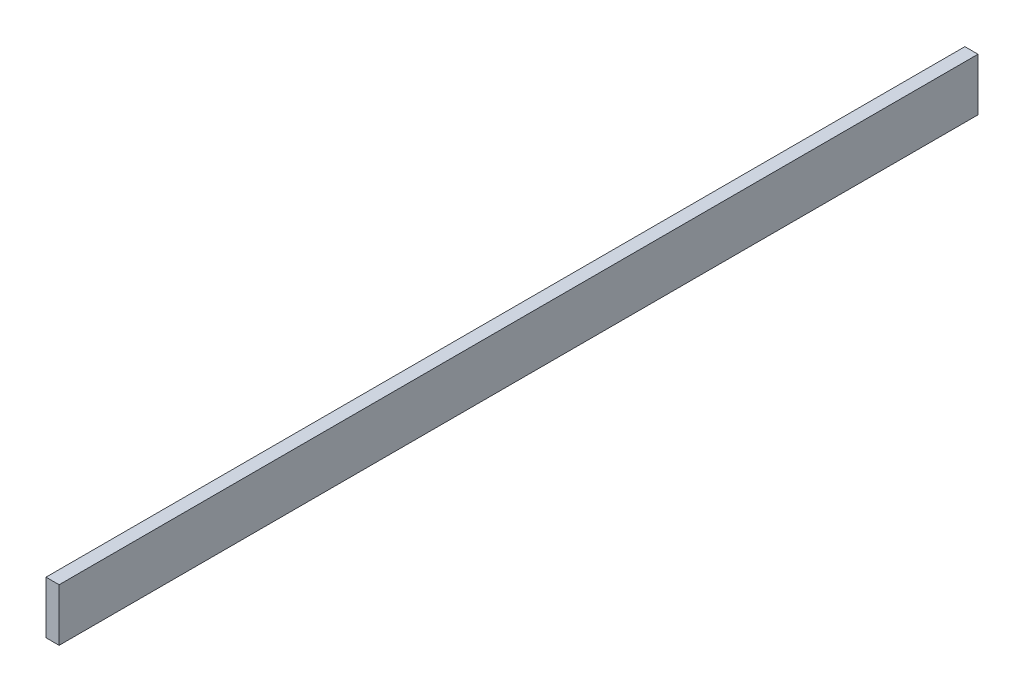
ISO-10303-21;
HEADER;
FILE_DESCRIPTION(('STEP AP214'),'2;1');
FILE_NAME('part.step','',(''),(''),'','','');
FILE_SCHEMA(('AUTOMOTIVE_DESIGN { 1 0 10303 214 1 1 1 1 }'));
ENDSEC;
DATA;
#1=APPLICATION_CONTEXT('core data for automotive mechanical design processes');
#2=APPLICATION_PROTOCOL_DEFINITION('international standard','automotive_design',2000,#1);
#3=PRODUCT_CONTEXT('',#1,'mechanical');
#4=PRODUCT('Part','Part','',(#3));
#5=PRODUCT_RELATED_PRODUCT_CATEGORY('part','',(#4));
#6=PRODUCT_DEFINITION_FORMATION('','',#4);
#7=PRODUCT_DEFINITION_CONTEXT('part definition',#1,'design');
#8=PRODUCT_DEFINITION('design','',#6,#7);
#9=PRODUCT_DEFINITION_SHAPE('','',#8);
#10=(LENGTH_UNIT() NAMED_UNIT(*) SI_UNIT(.MILLI.,.METRE.));
#11=(NAMED_UNIT(*) PLANE_ANGLE_UNIT() SI_UNIT($,.RADIAN.));
#12=(NAMED_UNIT(*) SI_UNIT($,.STERADIAN.) SOLID_ANGLE_UNIT());
#13=UNCERTAINTY_MEASURE_WITH_UNIT(LENGTH_MEASURE(1.E-05),#10,'distance_accuracy_value','');
#14=(GEOMETRIC_REPRESENTATION_CONTEXT(3) GLOBAL_UNCERTAINTY_ASSIGNED_CONTEXT((#13)) GLOBAL_UNIT_ASSIGNED_CONTEXT((#10,
#11,#12)) REPRESENTATION_CONTEXT('',''));
#15=CARTESIAN_POINT('',(0.,0.,0.));
#16=DIRECTION('',(0.,0.,1.));
#17=DIRECTION('',(1.,0.,0.));
#18=AXIS2_PLACEMENT_3D('',#15,#16,#17);
#19=CARTESIAN_POINT('',(-2.50000000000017,20.,350.));
#20=DIRECTION('',(1.,0.,0.));
#21=DIRECTION('',(0.,1.,0.));
#22=AXIS2_PLACEMENT_3D('',#19,#20,#21);
#23=PLANE('',#22);
#24=DIRECTION('',(0.,-1.,0.));
#25=VECTOR('',#24,1.);
#26=CARTESIAN_POINT('',(-2.5,20.,0.));
#27=LINE('',#26,#25);
#28=CARTESIAN_POINT('',(-2.5,20.,0.));
#29=VERTEX_POINT('',#28);
#30=CARTESIAN_POINT('',(-2.5,0.,0.));
#31=VERTEX_POINT('',#30);
#32=EDGE_CURVE('E83',#29,#31,#27,.T.);
#33=ORIENTED_EDGE('',*,*,#32,.T.);
#34=DIRECTION('',(0.,0.,-1.));
#35=VECTOR('',#34,1.);
#36=CARTESIAN_POINT('',(-2.50000000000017,0.,350.));
#37=LINE('',#36,#35);
#38=CARTESIAN_POINT('',(-2.50000000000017,0.,350.));
#39=VERTEX_POINT('',#38);
#40=EDGE_CURVE('E11',#39,#31,#37,.T.);
#41=ORIENTED_EDGE('',*,*,#40,.F.);
#42=DIRECTION('',(0.,-1.,0.));
#43=VECTOR('',#42,1.);
#44=CARTESIAN_POINT('',(-2.50000000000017,20.,350.));
#45=LINE('',#44,#43);
#46=CARTESIAN_POINT('',(-2.50000000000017,20.,350.));
#47=VERTEX_POINT('',#46);
#48=EDGE_CURVE('E107',#47,#39,#45,.T.);
#49=ORIENTED_EDGE('',*,*,#48,.F.);
#50=DIRECTION('',(0.,0.,-1.));
#51=VECTOR('',#50,1.);
#52=CARTESIAN_POINT('',(-2.50000000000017,20.,350.));
#53=LINE('',#52,#51);
#54=EDGE_CURVE('E96',#47,#29,#53,.T.);
#55=ORIENTED_EDGE('',*,*,#54,.T.);
#56=EDGE_LOOP('',(#33,#41,#49,#55));
#57=FACE_BOUND('',#56,.T.);
#58=ADVANCED_FACE('F38',(#57),#23,.F.);
#59=CARTESIAN_POINT('',(-2.50000000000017,0.,350.));
#60=DIRECTION('',(0.,1.,0.));
#61=DIRECTION('',(0.,0.,1.));
#62=AXIS2_PLACEMENT_3D('',#59,#60,#61);
#63=PLANE('',#62);
#64=DIRECTION('',(1.,0.,0.));
#65=VECTOR('',#64,1.);
#66=CARTESIAN_POINT('',(-2.5,0.,0.));
#67=LINE('',#66,#65);
#68=CARTESIAN_POINT('',(2.5,0.,0.));
#69=VERTEX_POINT('',#68);
#70=EDGE_CURVE('E79',#31,#69,#67,.T.);
#71=ORIENTED_EDGE('',*,*,#70,.T.);
#72=DIRECTION('',(0.,0.,-1.));
#73=VECTOR('',#72,1.);
#74=CARTESIAN_POINT('',(2.49999999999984,0.,350.));
#75=LINE('',#74,#73);
#76=CARTESIAN_POINT('',(2.49999999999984,0.,350.));
#77=VERTEX_POINT('',#76);
#78=EDGE_CURVE('E46',#77,#69,#75,.T.);
#79=ORIENTED_EDGE('',*,*,#78,.F.);
#80=DIRECTION('',(1.,0.,0.));
#81=VECTOR('',#80,1.);
#82=CARTESIAN_POINT('',(-2.50000000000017,0.,350.));
#83=LINE('',#82,#81);
#84=EDGE_CURVE('E92',#39,#77,#83,.T.);
#85=ORIENTED_EDGE('',*,*,#84,.F.);
#86=ORIENTED_EDGE('',*,*,#40,.T.);
#87=EDGE_LOOP('',(#71,#79,#85,#86));
#88=FACE_BOUND('',#87,.T.);
#89=ADVANCED_FACE('F91',(#88),#63,.F.);
#90=CARTESIAN_POINT('',(2.49999999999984,20.,350.));
#91=DIRECTION('',(-1.,0.,0.));
#92=DIRECTION('',(0.,-1.,0.));
#93=AXIS2_PLACEMENT_3D('',#90,#91,#92);
#94=PLANE('',#93);
#95=DIRECTION('',(0.,1.,0.));
#96=VECTOR('',#95,1.);
#97=CARTESIAN_POINT('',(2.5,20.,0.));
#98=LINE('',#97,#96);
#99=CARTESIAN_POINT('',(2.5,20.,0.));
#100=VERTEX_POINT('',#99);
#101=EDGE_CURVE('E84',#69,#100,#98,.T.);
#102=ORIENTED_EDGE('',*,*,#101,.T.);
#103=DIRECTION('',(0.,0.,-1.));
#104=VECTOR('',#103,1.);
#105=CARTESIAN_POINT('',(2.49999999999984,20.,350.));
#106=LINE('',#105,#104);
#107=CARTESIAN_POINT('',(2.49999999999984,20.,350.));
#108=VERTEX_POINT('',#107);
#109=EDGE_CURVE('E116',#108,#100,#106,.T.);
#110=ORIENTED_EDGE('',*,*,#109,.F.);
#111=DIRECTION('',(0.,1.,0.));
#112=VECTOR('',#111,1.);
#113=CARTESIAN_POINT('',(2.49999999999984,20.,350.));
#114=LINE('',#113,#112);
#115=EDGE_CURVE('E58',#77,#108,#114,.T.);
#116=ORIENTED_EDGE('',*,*,#115,.F.);
#117=ORIENTED_EDGE('',*,*,#78,.T.);
#118=EDGE_LOOP('',(#102,#110,#116,#117));
#119=FACE_BOUND('',#118,.T.);
#120=ADVANCED_FACE('F121',(#119),#94,.F.);
#121=CARTESIAN_POINT('',(-2.50000000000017,20.,350.));
#122=DIRECTION('',(0.,-1.,0.));
#123=DIRECTION('',(0.,0.,-1.));
#124=AXIS2_PLACEMENT_3D('',#121,#122,#123);
#125=PLANE('',#124);
#126=DIRECTION('',(-1.,0.,0.));
#127=VECTOR('',#126,1.);
#128=CARTESIAN_POINT('',(-2.5,20.,0.));
#129=LINE('',#128,#127);
#130=EDGE_CURVE('E104',#100,#29,#129,.T.);
#131=ORIENTED_EDGE('',*,*,#130,.T.);
#132=ORIENTED_EDGE('',*,*,#54,.F.);
#133=DIRECTION('',(-1.,0.,0.));
#134=VECTOR('',#133,1.);
#135=CARTESIAN_POINT('',(-2.50000000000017,20.,350.));
#136=LINE('',#135,#134);
#137=EDGE_CURVE('E53',#108,#47,#136,.T.);
#138=ORIENTED_EDGE('',*,*,#137,.F.);
#139=ORIENTED_EDGE('',*,*,#109,.T.);
#140=EDGE_LOOP('',(#131,#132,#138,#139));
#141=FACE_BOUND('',#140,.T.);
#142=ADVANCED_FACE('F123',(#141),#125,.F.);
#143=CARTESIAN_POINT('',(-2.50000000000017,0.,350.));
#144=DIRECTION('',(0.,0.,1.));
#145=DIRECTION('',(1.,0.,0.));
#146=AXIS2_PLACEMENT_3D('',#143,#144,#145);
#147=PLANE('',#146);
#148=ORIENTED_EDGE('',*,*,#48,.T.);
#149=ORIENTED_EDGE('',*,*,#84,.T.);
#150=ORIENTED_EDGE('',*,*,#115,.T.);
#151=ORIENTED_EDGE('',*,*,#137,.T.);
#152=EDGE_LOOP('',(#148,#149,#150,#151));
#153=FACE_BOUND('',#152,.T.);
#154=ADVANCED_FACE('F124',(#153),#147,.T.);
#155=CARTESIAN_POINT('',(-2.5,0.,0.));
#156=DIRECTION('',(0.,0.,1.));
#157=DIRECTION('',(1.,0.,0.));
#158=AXIS2_PLACEMENT_3D('',#155,#156,#157);
#159=PLANE('',#158);
#160=ORIENTED_EDGE('',*,*,#32,.F.);
#161=ORIENTED_EDGE('',*,*,#130,.F.);
#162=ORIENTED_EDGE('',*,*,#101,.F.);
#163=ORIENTED_EDGE('',*,*,#70,.F.);
#164=EDGE_LOOP('',(#160,#161,#162,#163));
#165=FACE_BOUND('',#164,.T.);
#166=ADVANCED_FACE('F80',(#165),#159,.F.);
#167=CLOSED_SHELL('',(#58,#89,#120,#142,#154,#166));
#168=MANIFOLD_SOLID_BREP('B2',#167);
#169=ADVANCED_BREP_SHAPE_REPRESENTATION('',(#18,#168),#14);
#170=SHAPE_DEFINITION_REPRESENTATION(#9,#169);
ENDSEC;
END-ISO-10303-21;
